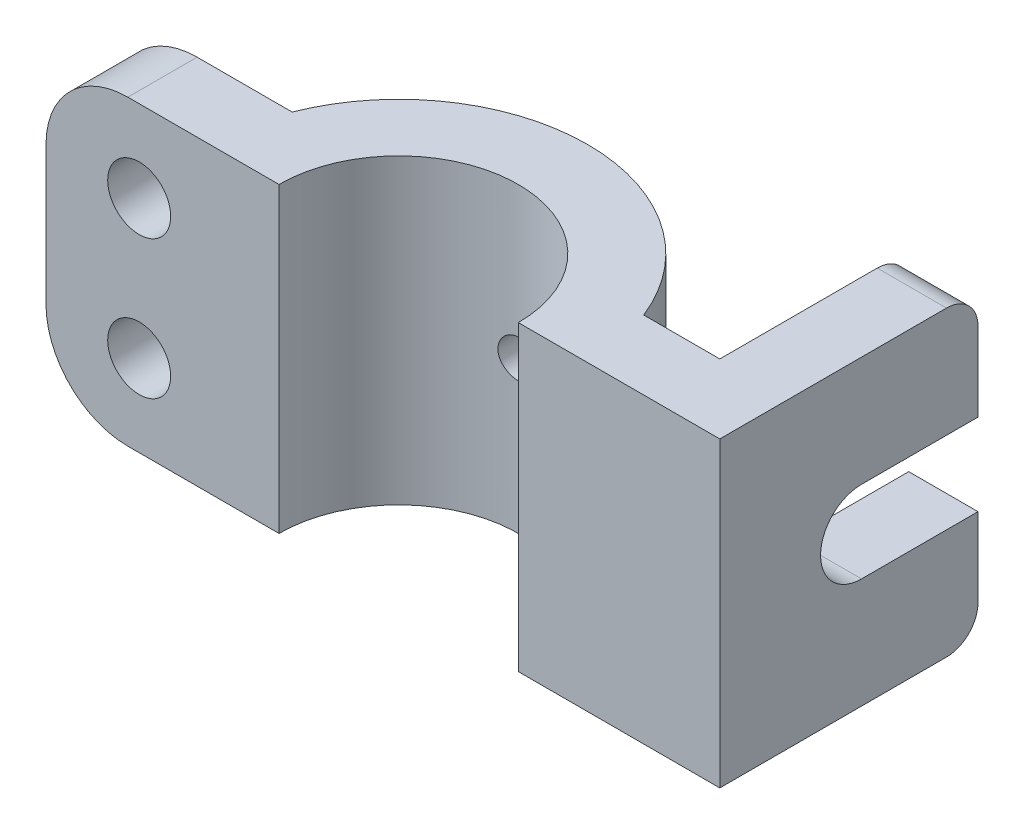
ISO-10303-21;
HEADER;
FILE_DESCRIPTION(('STEP AP214'),'2;1');
FILE_NAME('part.step','',(''),(''),'','','');
FILE_SCHEMA(('AUTOMOTIVE_DESIGN { 1 0 10303 214 1 1 1 1 }'));
ENDSEC;
DATA;
#1=APPLICATION_CONTEXT('core data for automotive mechanical design processes');
#2=APPLICATION_PROTOCOL_DEFINITION('international standard','automotive_design',2000,#1);
#3=PRODUCT_CONTEXT('',#1,'mechanical');
#4=PRODUCT('Part','Part','',(#3));
#5=PRODUCT_RELATED_PRODUCT_CATEGORY('part','',(#4));
#6=PRODUCT_DEFINITION_FORMATION('','',#4);
#7=PRODUCT_DEFINITION_CONTEXT('part definition',#1,'design');
#8=PRODUCT_DEFINITION('design','',#6,#7);
#9=PRODUCT_DEFINITION_SHAPE('','',#8);
#10=(LENGTH_UNIT() NAMED_UNIT(*) SI_UNIT(.MILLI.,.METRE.));
#11=(NAMED_UNIT(*) PLANE_ANGLE_UNIT() SI_UNIT($,.RADIAN.));
#12=(NAMED_UNIT(*) SI_UNIT($,.STERADIAN.) SOLID_ANGLE_UNIT());
#13=UNCERTAINTY_MEASURE_WITH_UNIT(LENGTH_MEASURE(1.E-05),#10,'distance_accuracy_value','');
#14=(GEOMETRIC_REPRESENTATION_CONTEXT(3) GLOBAL_UNCERTAINTY_ASSIGNED_CONTEXT((#13)) GLOBAL_UNIT_ASSIGNED_CONTEXT((#10,
#11,#12)) REPRESENTATION_CONTEXT('',''));
#15=CARTESIAN_POINT('',(0.,0.,0.));
#16=DIRECTION('',(0.,0.,1.));
#17=DIRECTION('',(1.,0.,0.));
#18=AXIS2_PLACEMENT_3D('',#15,#16,#17);
#19=CARTESIAN_POINT('',(107.,24.,-22.5));
#20=DIRECTION('',(1.,0.,0.));
#21=DIRECTION('',(0.,1.,0.));
#22=AXIS2_PLACEMENT_3D('',#19,#20,#21);
#23=CYLINDRICAL_SURFACE('',#22,6.5);
#24=DIRECTION('',(1.,0.,0.));
#25=VECTOR('',#24,1.);
#26=CARTESIAN_POINT('',(107.,30.5,-22.5));
#27=LINE('',#26,#25);
#28=CARTESIAN_POINT('',(107.,30.5,-22.5));
#29=VERTEX_POINT('',#28);
#30=CARTESIAN_POINT('',(96.,30.5,-22.5));
#31=VERTEX_POINT('',#30);
#32=EDGE_CURVE('E242',#29,#31,#27,.F.);
#33=ORIENTED_EDGE('',*,*,#32,.F.);
#34=CARTESIAN_POINT('',(107.,24.,-22.5));
#35=DIRECTION('',(1.,0.,0.));
#36=DIRECTION('',(0.,0.,-1.));
#37=AXIS2_PLACEMENT_3D('',#34,#35,#36);
#38=CIRCLE('',#37,6.5);
#39=CARTESIAN_POINT('',(107.,17.5,-22.5));
#40=VERTEX_POINT('',#39);
#41=EDGE_CURVE('E339',#29,#40,#38,.T.);
#42=ORIENTED_EDGE('',*,*,#41,.T.);
#43=DIRECTION('',(1.,0.,0.));
#44=VECTOR('',#43,1.);
#45=CARTESIAN_POINT('',(107.,17.5,-22.5));
#46=LINE('',#45,#44);
#47=CARTESIAN_POINT('',(96.,17.5,-22.5));
#48=VERTEX_POINT('',#47);
#49=EDGE_CURVE('E181',#48,#40,#46,.T.);
#50=ORIENTED_EDGE('',*,*,#49,.F.);
#51=CARTESIAN_POINT('',(96.,24.,-22.5));
#52=DIRECTION('',(-1.,0.,0.));
#53=DIRECTION('',(0.,0.,1.));
#54=AXIS2_PLACEMENT_3D('',#51,#52,#53);
#55=CIRCLE('',#54,6.5);
#56=EDGE_CURVE('E336',#48,#31,#55,.T.);
#57=ORIENTED_EDGE('',*,*,#56,.T.);
#58=EDGE_LOOP('',(#33,#42,#50,#57));
#59=FACE_BOUND('',#58,.T.);
#60=ADVANCED_FACE('F47',(#59),#23,.F.);
#61=CARTESIAN_POINT('',(0.,48.,-41.));
#62=DIRECTION('',(0.,0.,-1.));
#63=DIRECTION('',(-1.,0.,0.));
#64=AXIS2_PLACEMENT_3D('',#61,#62,#63);
#65=PLANE('',#64);
#66=DIRECTION('',(0.,-1.,0.));
#67=VECTOR('',#66,1.);
#68=CARTESIAN_POINT('',(96.,48.,-41.));
#69=LINE('',#68,#67);
#70=CARTESIAN_POINT('',(96.,43.,-41.));
#71=VERTEX_POINT('',#70);
#72=CARTESIAN_POINT('',(96.,30.5,-41.));
#73=VERTEX_POINT('',#72);
#74=EDGE_CURVE('E202',#71,#73,#69,.T.);
#75=ORIENTED_EDGE('',*,*,#74,.F.);
#76=DIRECTION('',(1.,0.,0.));
#77=VECTOR('',#76,1.);
#78=CARTESIAN_POINT('',(0.,43.,-41.));
#79=LINE('',#78,#77);
#80=CARTESIAN_POINT('',(107.,43.,-41.));
#81=VERTEX_POINT('',#80);
#82=EDGE_CURVE('E56',#71,#81,#79,.T.);
#83=ORIENTED_EDGE('',*,*,#82,.T.);
#84=DIRECTION('',(0.,-1.,0.));
#85=VECTOR('',#84,1.);
#86=CARTESIAN_POINT('',(107.,48.,-41.));
#87=LINE('',#86,#85);
#88=CARTESIAN_POINT('',(107.,30.5,-41.));
#89=VERTEX_POINT('',#88);
#90=EDGE_CURVE('E201',#81,#89,#87,.T.);
#91=ORIENTED_EDGE('',*,*,#90,.T.);
#92=DIRECTION('',(1.,0.,0.));
#93=VECTOR('',#92,1.);
#94=CARTESIAN_POINT('',(107.,30.5,-41.));
#95=LINE('',#94,#93);
#96=EDGE_CURVE('E186',#73,#89,#95,.T.);
#97=ORIENTED_EDGE('',*,*,#96,.F.);
#98=EDGE_LOOP('',(#75,#83,#91,#97));
#99=FACE_BOUND('',#98,.T.);
#100=ADVANCED_FACE('F288',(#99),#65,.T.);
#101=CARTESIAN_POINT('',(56.,48.,0.));
#102=DIRECTION('',(0.,-1.,0.));
#103=DIRECTION('',(0.,0.,-1.));
#104=AXIS2_PLACEMENT_3D('',#101,#102,#103);
#105=CYLINDRICAL_SURFACE('',#104,19.);
#106=CARTESIAN_POINT('',(56.,0.,0.));
#107=DIRECTION('',(0.,1.,0.));
#108=DIRECTION('',(0.,0.,1.));
#109=AXIS2_PLACEMENT_3D('',#106,#107,#108);
#110=CIRCLE('',#109,19.);
#111=CARTESIAN_POINT('',(75.,0.,0.));
#112=VERTEX_POINT('',#111);
#113=CARTESIAN_POINT('',(37.,0.,0.));
#114=VERTEX_POINT('',#113);
#115=EDGE_CURVE('E416',#112,#114,#110,.T.);
#116=ORIENTED_EDGE('',*,*,#115,.F.);
#117=DIRECTION('',(0.,-1.,0.));
#118=VECTOR('',#117,1.);
#119=CARTESIAN_POINT('',(75.,48.,0.));
#120=LINE('',#119,#118);
#121=CARTESIAN_POINT('',(75.,48.,0.));
#122=VERTEX_POINT('',#121);
#123=EDGE_CURVE('E213',#122,#112,#120,.T.);
#124=ORIENTED_EDGE('',*,*,#123,.F.);
#125=CARTESIAN_POINT('',(56.,48.,0.));
#126=DIRECTION('',(0.,1.,0.));
#127=DIRECTION('',(0.,0.,1.));
#128=AXIS2_PLACEMENT_3D('',#125,#126,#127);
#129=CIRCLE('',#128,19.);
#130=CARTESIAN_POINT('',(37.,48.,0.));
#131=VERTEX_POINT('',#130);
#132=EDGE_CURVE('E394',#122,#131,#129,.T.);
#133=ORIENTED_EDGE('',*,*,#132,.T.);
#134=DIRECTION('',(0.,-1.,0.));
#135=VECTOR('',#134,1.);
#136=CARTESIAN_POINT('',(37.,48.,0.));
#137=LINE('',#136,#135);
#138=EDGE_CURVE('E386',#131,#114,#137,.T.);
#139=ORIENTED_EDGE('',*,*,#138,.T.);
#140=EDGE_LOOP('',(#116,#124,#133,#139));
#141=FACE_BOUND('',#140,.T.);
#142=CARTESIAN_POINT('',(59.,24.,-18.7616630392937));
#143=CARTESIAN_POINT('',(58.9999931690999,23.832619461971,-18.7616659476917));
#144=CARTESIAN_POINT('',(58.9859444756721,23.6651444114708,-18.7639271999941));
#145=CARTESIAN_POINT('',(58.9301401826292,23.3348843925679,-18.7727207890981));
#146=CARTESIAN_POINT('',(58.8883582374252,23.1721040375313,-18.7792571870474));
#147=CARTESIAN_POINT('',(58.7783752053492,22.8560612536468,-18.7958427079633));
#148=CARTESIAN_POINT('',(58.7101952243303,22.7027913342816,-18.8058890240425));
#149=CARTESIAN_POINT('',(58.5494025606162,22.4098861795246,-18.8283590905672));
#150=CARTESIAN_POINT('',(58.4567929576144,22.2702492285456,-18.8407825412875));
#151=CARTESIAN_POINT('',(58.248894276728,22.0073175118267,-18.8667300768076));
#152=CARTESIAN_POINT('',(58.133431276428,21.8841610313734,-18.8802621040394));
#153=CARTESIAN_POINT('',(57.8834790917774,21.6588858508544,-18.9068313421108));
#154=CARTESIAN_POINT('',(57.7489888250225,21.5567683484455,-18.9198685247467));
#155=CARTESIAN_POINT('',(57.4639090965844,21.375955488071,-18.9440626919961));
#156=CARTESIAN_POINT('',(57.3132375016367,21.2973881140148,-18.9552092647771));
#157=CARTESIAN_POINT('',(57.000630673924,21.1667276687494,-18.9742781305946));
#158=CARTESIAN_POINT('',(56.8386960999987,21.1146330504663,-18.9822006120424));
#159=CARTESIAN_POINT('',(56.5095864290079,21.0388178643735,-18.9938725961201));
#160=CARTESIAN_POINT('',(56.342465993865,21.0148653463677,-18.9976561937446));
#161=CARTESIAN_POINT('',(56.0065381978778,20.9952935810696,-19.0007410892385));
#162=CARTESIAN_POINT('',(55.8377309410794,20.999672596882,-19.0000426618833));
#163=CARTESIAN_POINT('',(55.5048053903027,21.0364575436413,-18.9942693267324));
#164=CARTESIAN_POINT('',(55.3406587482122,21.0686138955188,-18.9892333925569));
#165=CARTESIAN_POINT('',(55.0201208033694,21.1596483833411,-18.9753943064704));
#166=CARTESIAN_POINT('',(54.8637297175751,21.2185272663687,-18.9665910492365));
#167=CARTESIAN_POINT('',(54.5623929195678,21.3615875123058,-18.9461397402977));
#168=CARTESIAN_POINT('',(54.4174974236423,21.445872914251,-18.9344800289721));
#169=CARTESIAN_POINT('',(54.1438123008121,21.6372775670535,-18.9096134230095));
#170=CARTESIAN_POINT('',(54.0150238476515,21.7443984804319,-18.8964064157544));
#171=CARTESIAN_POINT('',(53.7757358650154,21.979820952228,-18.8697464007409));
#172=CARTESIAN_POINT('',(53.6654508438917,22.1083405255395,-18.8562922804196));
#173=CARTESIAN_POINT('',(53.467978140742,22.3821742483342,-18.8307941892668));
#174=CARTESIAN_POINT('',(53.3807906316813,22.5274885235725,-18.8187502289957));
#175=CARTESIAN_POINT('',(53.2319528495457,22.8310218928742,-18.7974360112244));
#176=CARTESIAN_POINT('',(53.1703263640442,22.9892528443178,-18.7881683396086));
#177=CARTESIAN_POINT('',(53.0745850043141,23.3139988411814,-18.773500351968));
#178=CARTESIAN_POINT('',(53.0404679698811,23.4805132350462,-18.7680997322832));
#179=CARTESIAN_POINT('',(53.0010117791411,23.8151859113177,-18.7618354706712));
#180=CARTESIAN_POINT('',(52.995367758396,23.9833073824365,-18.7609237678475));
#181=CARTESIAN_POINT('',(53.0122072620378,24.3180941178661,-18.7636127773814));
#182=CARTESIAN_POINT('',(53.0346898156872,24.4847594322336,-18.7672133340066));
#183=CARTESIAN_POINT('',(53.1068850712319,24.8109473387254,-18.7784769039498));
#184=CARTESIAN_POINT('',(53.1564443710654,24.9705047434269,-18.7861170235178));
#185=CARTESIAN_POINT('',(53.2812261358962,25.2790486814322,-18.8045798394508));
#186=CARTESIAN_POINT('',(53.3564499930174,25.4280346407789,-18.8154027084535));
#187=CARTESIAN_POINT('',(53.5311520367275,25.7125686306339,-18.8391240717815));
#188=CARTESIAN_POINT('',(53.6308266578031,25.8479946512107,-18.8520390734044));
#189=CARTESIAN_POINT('',(53.8513293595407,26.1003069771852,-18.8784404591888));
#190=CARTESIAN_POINT('',(53.9721587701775,26.21719211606,-18.8919268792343));
#191=CARTESIAN_POINT('',(54.2328874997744,26.4302080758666,-18.9181025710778));
#192=CARTESIAN_POINT('',(54.3729533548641,26.5261362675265,-18.930783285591));
#193=CARTESIAN_POINT('',(54.6673892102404,26.6931000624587,-18.9537838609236));
#194=CARTESIAN_POINT('',(54.82175878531,26.7641364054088,-18.9641037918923));
#195=CARTESIAN_POINT('',(55.1398016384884,26.878980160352,-18.9811826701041));
#196=CARTESIAN_POINT('',(55.3034349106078,26.9228961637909,-18.9879558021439));
#197=CARTESIAN_POINT('',(55.635868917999,26.9826032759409,-18.997237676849));
#198=CARTESIAN_POINT('',(55.8046692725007,26.9983964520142,-18.999746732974));
#199=CARTESIAN_POINT('',(56.1406849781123,27.0013549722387,-19.0002140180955));
#200=CARTESIAN_POINT('',(56.3078976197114,26.9888295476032,-18.9982214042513));
#201=CARTESIAN_POINT('',(56.6378065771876,26.936172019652,-18.9900089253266));
#202=CARTESIAN_POINT('',(56.8005029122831,26.8960400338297,-18.9837890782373));
#203=CARTESIAN_POINT('',(57.1166606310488,26.7894224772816,-18.9678180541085));
#204=CARTESIAN_POINT('',(57.2701301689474,26.7229605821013,-18.9580700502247));
#205=CARTESIAN_POINT('',(57.5637877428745,26.5656034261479,-18.936110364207));
#206=CARTESIAN_POINT('',(57.7039752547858,26.4747072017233,-18.9238985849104));
#207=CARTESIAN_POINT('',(57.9686529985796,26.2699534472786,-18.8982087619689));
#208=CARTESIAN_POINT('',(58.092966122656,26.1558684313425,-18.8847189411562));
#209=CARTESIAN_POINT('',(58.3207945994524,25.9084539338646,-18.8580779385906));
#210=CARTESIAN_POINT('',(58.4243050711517,25.7751199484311,-18.8449268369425));
#211=CARTESIAN_POINT('',(58.6081801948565,25.4920031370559,-18.8203634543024));
#212=CARTESIAN_POINT('',(58.688395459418,25.3421223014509,-18.8089626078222));
#213=CARTESIAN_POINT('',(58.8223905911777,25.0309004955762,-18.7893250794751));
#214=CARTESIAN_POINT('',(58.8761974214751,24.8695714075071,-18.7810851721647));
#215=CARTESIAN_POINT('',(58.9438782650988,24.5896342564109,-18.7705711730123));
#216=CARTESIAN_POINT('',(58.9648910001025,24.472740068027,-18.7672487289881));
#217=CARTESIAN_POINT('',(58.9929541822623,24.2372463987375,-18.7627936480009));
#218=CARTESIAN_POINT('',(59.0000048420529,24.1186469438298,-18.7616609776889));
#219=CARTESIAN_POINT('',(59.,24.,-18.7616630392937));
#220=B_SPLINE_CURVE_WITH_KNOTS('',3,(#142,#143,#144,#145,#146,#147,#148,#149,#150,#151,#152,
#153,#154,#155,#156,#157,#158,#159,#160,#161,#162,#163,#164,#165,#166,#167,#168,#169,#170,#171,
#172,#173,#174,#175,#176,#177,#178,#179,#180,#181,#182,#183,#184,#185,#186,#187,#188,#189,#190,
#191,#192,#193,#194,#195,#196,#197,#198,#199,#200,#201,#202,#203,#204,#205,#206,#207,#208,#209,
#210,#211,#212,#213,#214,#215,#216,#217,#218,#219),.UNSPECIFIED.,.T.,.F.,(4,2,2,2,2,2,2,2,2,2,2,
2,2,2,2,2,2,2,2,2,2,2,2,2,2,2,2,2,2,2,2,2,2,2,2,2,2,2,4),(0.,0.501707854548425,1.00389299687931,
1.50567745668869,2.0073986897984,2.51309615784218,3.01882240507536,3.5272491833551,
4.03564624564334,4.53982297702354,5.04396879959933,5.54363144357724,6.04330805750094,
6.54505929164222,7.04684706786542,7.55410094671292,8.06135862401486,8.56908731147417,
9.07677612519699,9.57901733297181,10.0812412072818,10.5806488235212,11.0800835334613,
11.5836701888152,12.0872885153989,12.5955796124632,13.1038556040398,13.6100830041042,
14.1162731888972,14.6169626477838,15.1176499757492,15.6178881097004,16.118145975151,
16.6235713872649,17.1291152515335,17.6378328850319,18.1460300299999,18.5016688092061,
18.8573021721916),.UNSPECIFIED.);
#221=CARTESIAN_POINT('',(59.,24.,-18.7616630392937));
#222=VERTEX_POINT('',#221);
#223=EDGE_CURVE('E252',#222,#222,#220,.T.);
#224=ORIENTED_EDGE('',*,*,#223,.T.);
#225=EDGE_LOOP('',(#224));
#226=FACE_BOUND('',#225,.T.);
#227=ADVANCED_FACE('F283',(#141,#226),#105,.F.);
#228=CARTESIAN_POINT('',(56.,48.,0.));
#229=DIRECTION('',(0.,-1.,0.));
#230=DIRECTION('',(0.,0.,-1.));
#231=AXIS2_PLACEMENT_3D('',#228,#229,#230);
#232=CYLINDRICAL_SURFACE('',#231,30.);
#233=CARTESIAN_POINT('',(56.,0.,0.));
#234=DIRECTION('',(0.,1.,0.));
#235=DIRECTION('',(0.,0.,1.));
#236=AXIS2_PLACEMENT_3D('',#233,#234,#235);
#237=CIRCLE('',#236,30.);
#238=CARTESIAN_POINT('',(83.9105714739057,0.,-11.));
#239=VERTEX_POINT('',#238);
#240=CARTESIAN_POINT('',(28.0894285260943,0.,-11.));
#241=VERTEX_POINT('',#240);
#242=EDGE_CURVE('E398',#239,#241,#237,.T.);
#243=ORIENTED_EDGE('',*,*,#242,.T.);
#244=DIRECTION('',(0.,-1.,0.));
#245=VECTOR('',#244,1.);
#246=CARTESIAN_POINT('',(28.0894285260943,48.,-11.));
#247=LINE('',#246,#245);
#248=CARTESIAN_POINT('',(28.0894285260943,48.,-11.));
#249=VERTEX_POINT('',#248);
#250=EDGE_CURVE('E372',#249,#241,#247,.T.);
#251=ORIENTED_EDGE('',*,*,#250,.F.);
#252=CARTESIAN_POINT('',(56.,48.,0.));
#253=DIRECTION('',(0.,1.,0.));
#254=DIRECTION('',(0.,0.,1.));
#255=AXIS2_PLACEMENT_3D('',#252,#253,#254);
#256=CIRCLE('',#255,30.);
#257=CARTESIAN_POINT('',(83.9105714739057,48.,-11.));
#258=VERTEX_POINT('',#257);
#259=EDGE_CURVE('E426',#258,#249,#256,.T.);
#260=ORIENTED_EDGE('',*,*,#259,.F.);
#261=DIRECTION('',(0.,-1.,0.));
#262=VECTOR('',#261,1.);
#263=CARTESIAN_POINT('',(83.9105714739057,48.,-11.));
#264=LINE('',#263,#262);
#265=EDGE_CURVE('E367',#258,#239,#264,.T.);
#266=ORIENTED_EDGE('',*,*,#265,.T.);
#267=EDGE_LOOP('',(#243,#251,#260,#266));
#268=FACE_BOUND('',#267,.T.);
#269=CARTESIAN_POINT('',(59.,24.,-29.8496231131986));
#270=CARTESIAN_POINT('',(58.9999927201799,23.8319413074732,-29.8496250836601));
#271=CARTESIAN_POINT('',(58.9858305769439,23.6637714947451,-29.8510577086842));
#272=CARTESIAN_POINT('',(58.9295489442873,23.3320944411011,-29.856632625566));
#273=CARTESIAN_POINT('',(58.887398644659,23.1685925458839,-29.8607779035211));
#274=CARTESIAN_POINT('',(58.7763803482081,22.8511025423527,-29.8713039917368));
#275=CARTESIAN_POINT('',(58.7075285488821,22.6971087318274,-29.8776834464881));
#276=CARTESIAN_POINT('',(58.545092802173,22.402896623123,-29.8919574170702));
#277=CARTESIAN_POINT('',(58.4515137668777,22.2626755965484,-29.8998516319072));
#278=CARTESIAN_POINT('',(58.2419142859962,21.999446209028,-29.9162978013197));
#279=CARTESIAN_POINT('',(58.1258222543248,21.8764949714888,-29.9248518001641));
#280=CARTESIAN_POINT('',(57.8746451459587,21.6517871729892,-29.9416351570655));
#281=CARTESIAN_POINT('',(57.7395592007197,21.550031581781,-29.9498645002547));
#282=CARTESIAN_POINT('',(57.453879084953,21.3704062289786,-29.9650914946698));
#283=CARTESIAN_POINT('',(57.3032529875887,21.292587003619,-29.9720865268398));
#284=CARTESIAN_POINT('',(56.9909899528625,21.1633667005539,-29.9840345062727));
#285=CARTESIAN_POINT('',(56.8293532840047,21.1119649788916,-29.9889875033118));
#286=CARTESIAN_POINT('',(56.5002343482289,21.0372062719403,-29.9962789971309));
#287=CARTESIAN_POINT('',(56.3327735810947,21.0137555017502,-29.9986262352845));
#288=CARTESIAN_POINT('',(55.9962777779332,20.9952741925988,-30.0004714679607));
#289=CARTESIAN_POINT('',(55.8272427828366,21.0002429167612,-29.9999695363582));
#290=CARTESIAN_POINT('',(55.4930334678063,21.0383834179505,-29.9961801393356));
#291=CARTESIAN_POINT('',(55.3278475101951,21.0714543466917,-29.9929026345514));
#292=CARTESIAN_POINT('',(55.0053824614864,21.1647033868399,-29.9839418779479));
#293=CARTESIAN_POINT('',(54.8481034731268,21.2248818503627,-29.9782585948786));
#294=CARTESIAN_POINT('',(54.5455990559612,21.3707482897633,-29.9651081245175));
#295=CARTESIAN_POINT('',(54.4003952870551,21.4564808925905,-29.9576378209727));
#296=CARTESIAN_POINT('',(54.1263994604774,21.6509895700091,-29.9417515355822));
#297=CARTESIAN_POINT('',(53.9976078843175,21.7597663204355,-29.9333355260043));
#298=CARTESIAN_POINT('',(53.7595016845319,21.9978426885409,-29.9164588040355));
#299=CARTESIAN_POINT('',(53.650274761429,22.1272300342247,-29.9079980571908));
#300=CARTESIAN_POINT('',(53.4550773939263,22.4025505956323,-29.8920221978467));
#301=CARTESIAN_POINT('',(53.3691069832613,22.5484838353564,-29.8845070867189));
#302=CARTESIAN_POINT('',(53.2228634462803,22.8528210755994,-29.8712726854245));
#303=CARTESIAN_POINT('',(53.1625957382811,23.0112276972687,-29.8655537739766));
#304=CARTESIAN_POINT('',(53.0695377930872,23.3359818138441,-29.8565670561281));
#305=CARTESIAN_POINT('',(53.0367467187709,23.5023290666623,-29.853299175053));
#306=CARTESIAN_POINT('',(52.9996856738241,23.8374725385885,-29.8495974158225));
#307=CARTESIAN_POINT('',(52.9952930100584,24.0062550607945,-29.8491513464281));
#308=CARTESIAN_POINT('',(53.0148312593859,24.3421537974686,-29.8511115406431));
#309=CARTESIAN_POINT('',(53.0387617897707,24.5092700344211,-29.8535177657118));
#310=CARTESIAN_POINT('',(53.1141644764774,24.836734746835,-29.860900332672));
#311=CARTESIAN_POINT('',(53.1655786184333,24.997096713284,-29.8658712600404));
#312=CARTESIAN_POINT('',(53.2944298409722,25.3069201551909,-29.8778187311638));
#313=CARTESIAN_POINT('',(53.3718675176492,25.4563813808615,-29.8847953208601));
#314=CARTESIAN_POINT('',(53.5508749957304,25.7407199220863,-29.8999975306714));
#315=CARTESIAN_POINT('',(53.6525261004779,25.8755458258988,-29.9082273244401));
#316=CARTESIAN_POINT('',(53.8769583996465,26.1262651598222,-29.9249949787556));
#317=CARTESIAN_POINT('',(53.9997401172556,26.2421581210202,-29.933532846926));
#318=CARTESIAN_POINT('',(54.2634805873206,26.4521449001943,-29.949991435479));
#319=CARTESIAN_POINT('',(54.4045032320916,26.5461586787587,-29.9579098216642));
#320=CARTESIAN_POINT('',(54.7004068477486,26.7091676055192,-29.9722032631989));
#321=CARTESIAN_POINT('',(54.8552876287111,26.7781630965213,-29.9785783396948));
#322=CARTESIAN_POINT('',(55.1742316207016,26.889041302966,-29.9890563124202));
#323=CARTESIAN_POINT('',(55.3382778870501,26.9309723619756,-29.9931632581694));
#324=CARTESIAN_POINT('',(55.671125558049,26.9866892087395,-29.9986588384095));
#325=CARTESIAN_POINT('',(55.8399268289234,27.0004757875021,-30.0000475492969));
#326=CARTESIAN_POINT('',(56.1767066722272,26.9995012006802,-29.9999501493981));
#327=CARTESIAN_POINT('',(56.3446856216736,26.98486428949,-29.9984765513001));
#328=CARTESIAN_POINT('',(56.6757856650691,26.9277187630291,-29.9928448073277));
#329=CARTESIAN_POINT('',(56.8389067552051,26.8852101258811,-29.9886866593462));
#330=CARTESIAN_POINT('',(57.1556597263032,26.7735622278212,-29.9781517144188));
#331=CARTESIAN_POINT('',(57.3092928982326,26.7044265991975,-29.9717752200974));
#332=CARTESIAN_POINT('',(57.6027938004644,26.5415004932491,-29.9575143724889));
#333=CARTESIAN_POINT('',(57.7426616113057,26.4477101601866,-29.9496300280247));
#334=CARTESIAN_POINT('',(58.0052981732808,26.2376711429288,-29.9331955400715));
#335=CARTESIAN_POINT('',(58.127992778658,26.1213299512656,-29.9246427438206));
#336=CARTESIAN_POINT('',(58.3521732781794,25.8696739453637,-29.9078577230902));
#337=CARTESIAN_POINT('',(58.4536540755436,25.7343545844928,-29.8996255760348));
#338=CARTESIAN_POINT('',(58.6327299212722,25.4482069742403,-29.8843915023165));
#339=CARTESIAN_POINT('',(58.7102635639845,25.2973401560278,-29.8773927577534));
#340=CARTESIAN_POINT('',(58.8387941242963,24.9847551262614,-29.8654558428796));
#341=CARTESIAN_POINT('',(58.8898209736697,24.8230493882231,-29.8605153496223));
#342=CARTESIAN_POINT('',(58.9511650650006,24.5503567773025,-29.8545002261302));
#343=CARTESIAN_POINT('',(58.9694531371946,24.4411132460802,-29.8526799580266));
#344=CARTESIAN_POINT('',(58.9938729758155,24.2212625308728,-29.8502407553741));
#345=CARTESIAN_POINT('',(59.0000047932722,24.1106553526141,-29.8496218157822));
#346=CARTESIAN_POINT('',(59.,24.,-29.8496231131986));
#347=B_SPLINE_CURVE_WITH_KNOTS('',3,(#269,#270,#271,#272,#273,#274,#275,#276,#277,#278,#279,
#280,#281,#282,#283,#284,#285,#286,#287,#288,#289,#290,#291,#292,#293,#294,#295,#296,#297,#298,
#299,#300,#301,#302,#303,#304,#305,#306,#307,#308,#309,#310,#311,#312,#313,#314,#315,#316,#317,
#318,#319,#320,#321,#322,#323,#324,#325,#326,#327,#328,#329,#330,#331,#332,#333,#334,#335,#336,
#337,#338,#339,#340,#341,#342,#343,#344,#345,#346),.UNSPECIFIED.,.T.,.F.,(4,2,2,2,2,2,2,2,2,2,2,
2,2,2,2,2,2,2,2,2,2,2,2,2,2,2,2,2,2,2,2,2,2,2,2,2,2,2,4),(0.,0.503771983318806,1.00809945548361,
1.51212147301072,2.01604344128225,2.52159484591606,3.02716937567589,3.53380409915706,
4.04042647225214,4.5453441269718,5.05024868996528,5.55334895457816,6.05645575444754,
6.56044636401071,7.06445175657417,7.57066275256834,8.07687448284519,8.58319287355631,
9.08949583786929,9.59360988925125,10.0977171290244,10.6007644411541,11.1038232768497,
11.6085956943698,12.1133806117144,12.6199841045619,13.1265806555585,13.6322697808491,
14.1379446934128,14.6414140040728,15.144883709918,15.6482847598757,16.1516828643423,
16.657191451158,17.1628213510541,17.6697372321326,18.1760794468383,18.5077808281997,
18.8394808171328),.UNSPECIFIED.);
#348=CARTESIAN_POINT('',(59.,24.,-29.8496231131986));
#349=VERTEX_POINT('',#348);
#350=EDGE_CURVE('E243',#349,#349,#347,.T.);
#351=ORIENTED_EDGE('',*,*,#350,.F.);
#352=EDGE_LOOP('',(#351));
#353=FACE_BOUND('',#352,.T.);
#354=ADVANCED_FACE('F255',(#268,#353),#232,.T.);
#355=CARTESIAN_POINT('',(0.,48.,0.));
#356=DIRECTION('',(0.,0.,1.));
#357=DIRECTION('',(1.,0.,0.));
#358=AXIS2_PLACEMENT_3D('',#355,#356,#357);
#359=PLANE('',#358);
#360=DIRECTION('',(-1.,0.,0.));
#361=VECTOR('',#360,1.);
#362=CARTESIAN_POINT('',(0.,0.,0.));
#363=LINE('',#362,#361);
#364=CARTESIAN_POINT('',(107.,0.,0.));
#365=VERTEX_POINT('',#364);
#366=EDGE_CURVE('E412',#365,#112,#363,.T.);
#367=ORIENTED_EDGE('',*,*,#366,.F.);
#368=DIRECTION('',(0.,-1.,0.));
#369=VECTOR('',#368,1.);
#370=CARTESIAN_POINT('',(107.,48.,0.));
#371=LINE('',#370,#369);
#372=CARTESIAN_POINT('',(107.,48.,0.));
#373=VERTEX_POINT('',#372);
#374=EDGE_CURVE('E206',#373,#365,#371,.T.);
#375=ORIENTED_EDGE('',*,*,#374,.F.);
#376=DIRECTION('',(-1.,0.,0.));
#377=VECTOR('',#376,1.);
#378=CARTESIAN_POINT('',(0.,48.,0.));
#379=LINE('',#378,#377);
#380=EDGE_CURVE('E439',#373,#122,#379,.T.);
#381=ORIENTED_EDGE('',*,*,#380,.T.);
#382=ORIENTED_EDGE('',*,*,#123,.T.);
#383=EDGE_LOOP('',(#367,#375,#381,#382));
#384=FACE_BOUND('',#383,.T.);
#385=ADVANCED_FACE('F290',(#384),#359,.T.);
#386=CARTESIAN_POINT('',(107.,48.,0.));
#387=DIRECTION('',(1.,0.,0.));
#388=DIRECTION('',(0.,0.,-1.));
#389=AXIS2_PLACEMENT_3D('',#386,#387,#388);
#390=PLANE('',#389);
#391=DIRECTION('',(0.,0.,1.));
#392=VECTOR('',#391,1.);
#393=CARTESIAN_POINT('',(107.,0.,0.));
#394=LINE('',#393,#392);
#395=CARTESIAN_POINT('',(107.,0.,-36.));
#396=VERTEX_POINT('',#395);
#397=EDGE_CURVE('E409',#396,#365,#394,.T.);
#398=ORIENTED_EDGE('',*,*,#397,.F.);
#399=CARTESIAN_POINT('',(107.,5.,-36.));
#400=DIRECTION('',(1.,0.,0.));
#401=DIRECTION('',(0.,0.,-1.));
#402=AXIS2_PLACEMENT_3D('',#399,#400,#401);
#403=CIRCLE('',#402,5.);
#404=CARTESIAN_POINT('',(107.,5.,-41.));
#405=VERTEX_POINT('',#404);
#406=EDGE_CURVE('E199',#396,#405,#403,.T.);
#407=ORIENTED_EDGE('',*,*,#406,.T.);
#408=CARTESIAN_POINT('',(107.,17.5,-41.));
#409=VERTEX_POINT('',#408);
#410=EDGE_CURVE('E191',#409,#405,#87,.T.);
#411=ORIENTED_EDGE('',*,*,#410,.F.);
#412=DIRECTION('',(0.,0.,-1.));
#413=VECTOR('',#412,1.);
#414=CARTESIAN_POINT('',(107.,17.5,-16.));
#415=LINE('',#414,#413);
#416=EDGE_CURVE('E174',#40,#409,#415,.T.);
#417=ORIENTED_EDGE('',*,*,#416,.F.);
#418=ORIENTED_EDGE('',*,*,#41,.F.);
#419=DIRECTION('',(0.,0.,-1.));
#420=VECTOR('',#419,1.);
#421=CARTESIAN_POINT('',(107.,30.5,-16.));
#422=LINE('',#421,#420);
#423=EDGE_CURVE('E253',#29,#89,#422,.T.);
#424=ORIENTED_EDGE('',*,*,#423,.T.);
#425=ORIENTED_EDGE('',*,*,#90,.F.);
#426=CARTESIAN_POINT('',(107.,43.,-36.));
#427=DIRECTION('',(1.,0.,0.));
#428=DIRECTION('',(0.,0.,-1.));
#429=AXIS2_PLACEMENT_3D('',#426,#427,#428);
#430=CIRCLE('',#429,5.);
#431=CARTESIAN_POINT('',(107.,48.,-36.));
#432=VERTEX_POINT('',#431);
#433=EDGE_CURVE('E331',#81,#432,#430,.T.);
#434=ORIENTED_EDGE('',*,*,#433,.T.);
#435=DIRECTION('',(0.,0.,1.));
#436=VECTOR('',#435,1.);
#437=CARTESIAN_POINT('',(107.,48.,0.));
#438=LINE('',#437,#436);
#439=EDGE_CURVE('E436',#432,#373,#438,.T.);
#440=ORIENTED_EDGE('',*,*,#439,.T.);
#441=ORIENTED_EDGE('',*,*,#374,.T.);
#442=EDGE_LOOP('',(#398,#407,#411,#417,#418,#424,#425,#434,#440,#441));
#443=FACE_BOUND('',#442,.T.);
#444=ADVANCED_FACE('F198',(#443),#390,.T.);
#445=ORIENTED_EDGE('',*,*,#410,.T.);
#446=DIRECTION('',(1.,0.,0.));
#447=VECTOR('',#446,1.);
#448=CARTESIAN_POINT('',(96.,5.,-41.));
#449=LINE('',#448,#447);
#450=CARTESIAN_POINT('',(96.,5.,-41.));
#451=VERTEX_POINT('',#450);
#452=EDGE_CURVE('E315',#405,#451,#449,.F.);
#453=ORIENTED_EDGE('',*,*,#452,.T.);
#454=CARTESIAN_POINT('',(96.,17.5,-41.));
#455=VERTEX_POINT('',#454);
#456=EDGE_CURVE('E194',#455,#451,#69,.T.);
#457=ORIENTED_EDGE('',*,*,#456,.F.);
#458=DIRECTION('',(-1.,0.,0.));
#459=VECTOR('',#458,1.);
#460=CARTESIAN_POINT('',(107.,17.5,-41.));
#461=LINE('',#460,#459);
#462=EDGE_CURVE('E178',#409,#455,#461,.T.);
#463=ORIENTED_EDGE('',*,*,#462,.F.);
#464=EDGE_LOOP('',(#445,#453,#457,#463));
#465=FACE_BOUND('',#464,.T.);
#466=ADVANCED_FACE('F190',(#465),#65,.T.);
#467=CARTESIAN_POINT('',(96.,48.,0.));
#468=DIRECTION('',(-1.,0.,0.));
#469=DIRECTION('',(0.,0.,1.));
#470=AXIS2_PLACEMENT_3D('',#467,#468,#469);
#471=PLANE('',#470);
#472=ORIENTED_EDGE('',*,*,#456,.T.);
#473=CARTESIAN_POINT('',(96.,5.,-36.));
#474=DIRECTION('',(-1.,0.,0.));
#475=DIRECTION('',(0.,0.,1.));
#476=AXIS2_PLACEMENT_3D('',#473,#474,#475);
#477=CIRCLE('',#476,5.);
#478=CARTESIAN_POINT('',(96.,0.,-36.));
#479=VERTEX_POINT('',#478);
#480=EDGE_CURVE('E314',#451,#479,#477,.T.);
#481=ORIENTED_EDGE('',*,*,#480,.T.);
#482=DIRECTION('',(0.,0.,-1.));
#483=VECTOR('',#482,1.);
#484=CARTESIAN_POINT('',(96.,0.,0.));
#485=LINE('',#484,#483);
#486=CARTESIAN_POINT('',(96.,0.,-11.));
#487=VERTEX_POINT('',#486);
#488=EDGE_CURVE('E406',#487,#479,#485,.T.);
#489=ORIENTED_EDGE('',*,*,#488,.F.);
#490=DIRECTION('',(0.,-1.,0.));
#491=VECTOR('',#490,1.);
#492=CARTESIAN_POINT('',(96.,48.,-11.));
#493=LINE('',#492,#491);
#494=CARTESIAN_POINT('',(96.,48.,-11.));
#495=VERTEX_POINT('',#494);
#496=EDGE_CURVE('E365',#495,#487,#493,.T.);
#497=ORIENTED_EDGE('',*,*,#496,.F.);
#498=DIRECTION('',(0.,0.,-1.));
#499=VECTOR('',#498,1.);
#500=CARTESIAN_POINT('',(96.,48.,0.));
#501=LINE('',#500,#499);
#502=CARTESIAN_POINT('',(96.,48.,-36.));
#503=VERTEX_POINT('',#502);
#504=EDGE_CURVE('E433',#495,#503,#501,.T.);
#505=ORIENTED_EDGE('',*,*,#504,.T.);
#506=CARTESIAN_POINT('',(96.,43.,-36.));
#507=DIRECTION('',(-1.,0.,0.));
#508=DIRECTION('',(0.,0.,1.));
#509=AXIS2_PLACEMENT_3D('',#506,#507,#508);
#510=CIRCLE('',#509,5.);
#511=EDGE_CURVE('E63',#503,#71,#510,.T.);
#512=ORIENTED_EDGE('',*,*,#511,.T.);
#513=ORIENTED_EDGE('',*,*,#74,.T.);
#514=DIRECTION('',(0.,0.,-1.));
#515=VECTOR('',#514,1.);
#516=CARTESIAN_POINT('',(96.,30.5,-16.));
#517=LINE('',#516,#515);
#518=EDGE_CURVE('E350',#31,#73,#517,.T.);
#519=ORIENTED_EDGE('',*,*,#518,.F.);
#520=ORIENTED_EDGE('',*,*,#56,.F.);
#521=DIRECTION('',(0.,0.,-1.));
#522=VECTOR('',#521,1.);
#523=CARTESIAN_POINT('',(96.,17.5,-16.));
#524=LINE('',#523,#522);
#525=EDGE_CURVE('E185',#48,#455,#524,.T.);
#526=ORIENTED_EDGE('',*,*,#525,.T.);
#527=EDGE_LOOP('',(#472,#481,#489,#497,#505,#512,#513,#519,#520,#526));
#528=FACE_BOUND('',#527,.T.);
#529=ADVANCED_FACE('F353',(#528),#471,.T.);
#530=CARTESIAN_POINT('',(0.,48.,-11.));
#531=DIRECTION('',(0.,0.,-1.));
#532=DIRECTION('',(-1.,0.,0.));
#533=AXIS2_PLACEMENT_3D('',#530,#531,#532);
#534=PLANE('',#533);
#535=DIRECTION('',(1.,0.,0.));
#536=VECTOR('',#535,1.);
#537=CARTESIAN_POINT('',(0.,0.,-11.));
#538=LINE('',#537,#536);
#539=EDGE_CURVE('E402',#239,#487,#538,.T.);
#540=ORIENTED_EDGE('',*,*,#539,.F.);
#541=ORIENTED_EDGE('',*,*,#265,.F.);
#542=DIRECTION('',(1.,0.,0.));
#543=VECTOR('',#542,1.);
#544=CARTESIAN_POINT('',(0.,48.,-11.));
#545=LINE('',#544,#543);
#546=EDGE_CURVE('E430',#258,#495,#545,.T.);
#547=ORIENTED_EDGE('',*,*,#546,.T.);
#548=ORIENTED_EDGE('',*,*,#496,.T.);
#549=EDGE_LOOP('',(#540,#541,#547,#548));
#550=FACE_BOUND('',#549,.T.);
#551=ADVANCED_FACE('F489',(#550),#534,.T.);
#552=CARTESIAN_POINT('',(0.,48.,-11.));
#553=DIRECTION('',(0.,0.,-1.));
#554=DIRECTION('',(-1.,0.,0.));
#555=AXIS2_PLACEMENT_3D('',#552,#553,#554);
#556=PLANE('',#555);
#557=CARTESIAN_POINT('',(14.795365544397,35.,-11.));
#558=DIRECTION('',(0.,0.,-1.));
#559=DIRECTION('',(-1.,0.,0.));
#560=AXIS2_PLACEMENT_3D('',#557,#558,#559);
#561=CIRCLE('',#560,5.);
#562=CARTESIAN_POINT('',(9.79536554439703,35.,-11.));
#563=VERTEX_POINT('',#562);
#564=EDGE_CURVE('E452',#563,#563,#561,.T.);
#565=ORIENTED_EDGE('',*,*,#564,.F.);
#566=EDGE_LOOP('',(#565));
#567=FACE_BOUND('',#566,.T.);
#568=CARTESIAN_POINT('',(14.795365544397,13.,-11.));
#569=DIRECTION('',(0.,0.,-1.));
#570=DIRECTION('',(-1.,0.,0.));
#571=AXIS2_PLACEMENT_3D('',#568,#569,#570);
#572=CIRCLE('',#571,5.);
#573=CARTESIAN_POINT('',(9.79536554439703,13.,-11.));
#574=VERTEX_POINT('',#573);
#575=EDGE_CURVE('E449',#574,#574,#572,.T.);
#576=ORIENTED_EDGE('',*,*,#575,.F.);
#577=EDGE_LOOP('',(#576));
#578=FACE_BOUND('',#577,.T.);
#579=DIRECTION('',(1.,0.,0.));
#580=VECTOR('',#579,1.);
#581=CARTESIAN_POINT('',(0.,0.,-11.));
#582=LINE('',#581,#580);
#583=CARTESIAN_POINT('',(13.,0.,-11.));
#584=VERTEX_POINT('',#583);
#585=EDGE_CURVE('E395',#584,#241,#582,.T.);
#586=ORIENTED_EDGE('',*,*,#585,.F.);
#587=CARTESIAN_POINT('',(13.,13.,-11.));
#588=DIRECTION('',(0.,0.,-1.));
#589=DIRECTION('',(-1.,0.,0.));
#590=AXIS2_PLACEMENT_3D('',#587,#588,#589);
#591=CIRCLE('',#590,13.);
#592=CARTESIAN_POINT('',(0.,13.,-11.));
#593=VERTEX_POINT('',#592);
#594=EDGE_CURVE('E223',#584,#593,#591,.T.);
#595=ORIENTED_EDGE('',*,*,#594,.T.);
#596=DIRECTION('',(0.,-1.,0.));
#597=VECTOR('',#596,1.);
#598=CARTESIAN_POINT('',(0.,48.,-11.));
#599=LINE('',#598,#597);
#600=CARTESIAN_POINT('',(0.,35.,-11.));
#601=VERTEX_POINT('',#600);
#602=EDGE_CURVE('E378',#601,#593,#599,.T.);
#603=ORIENTED_EDGE('',*,*,#602,.F.);
#604=CARTESIAN_POINT('',(13.,35.,-11.));
#605=DIRECTION('',(0.,0.,-1.));
#606=DIRECTION('',(-1.,0.,0.));
#607=AXIS2_PLACEMENT_3D('',#604,#605,#606);
#608=CIRCLE('',#607,13.);
#609=CARTESIAN_POINT('',(13.,48.,-11.));
#610=VERTEX_POINT('',#609);
#611=EDGE_CURVE('E220',#601,#610,#608,.T.);
#612=ORIENTED_EDGE('',*,*,#611,.T.);
#613=DIRECTION('',(1.,0.,0.));
#614=VECTOR('',#613,1.);
#615=CARTESIAN_POINT('',(0.,48.,-11.));
#616=LINE('',#615,#614);
#617=EDGE_CURVE('E423',#610,#249,#616,.T.);
#618=ORIENTED_EDGE('',*,*,#617,.T.);
#619=ORIENTED_EDGE('',*,*,#250,.T.);
#620=EDGE_LOOP('',(#586,#595,#603,#612,#618,#619));
#621=FACE_BOUND('',#620,.T.);
#622=ADVANCED_FACE('F486',(#567,#578,#621),#556,.T.);
#623=CARTESIAN_POINT('',(0.,48.,0.));
#624=DIRECTION('',(-1.,0.,0.));
#625=DIRECTION('',(0.,0.,1.));
#626=AXIS2_PLACEMENT_3D('',#623,#624,#625);
#627=PLANE('',#626);
#628=ORIENTED_EDGE('',*,*,#602,.T.);
#629=DIRECTION('',(0.,0.,-1.));
#630=VECTOR('',#629,1.);
#631=CARTESIAN_POINT('',(0.,13.,0.));
#632=LINE('',#631,#630);
#633=CARTESIAN_POINT('',(0.,13.,0.));
#634=VERTEX_POINT('',#633);
#635=EDGE_CURVE('E230',#593,#634,#632,.F.);
#636=ORIENTED_EDGE('',*,*,#635,.T.);
#637=DIRECTION('',(0.,-1.,0.));
#638=VECTOR('',#637,1.);
#639=CARTESIAN_POINT('',(0.,48.,0.));
#640=LINE('',#639,#638);
#641=CARTESIAN_POINT('',(0.,35.,0.));
#642=VERTEX_POINT('',#641);
#643=EDGE_CURVE('E382',#642,#634,#640,.T.);
#644=ORIENTED_EDGE('',*,*,#643,.F.);
#645=DIRECTION('',(0.,0.,-1.));
#646=VECTOR('',#645,1.);
#647=CARTESIAN_POINT('',(0.,35.,0.));
#648=LINE('',#647,#646);
#649=EDGE_CURVE('E226',#642,#601,#648,.T.);
#650=ORIENTED_EDGE('',*,*,#649,.T.);
#651=EDGE_LOOP('',(#628,#636,#644,#650));
#652=FACE_BOUND('',#651,.T.);
#653=ADVANCED_FACE('F484',(#652),#627,.T.);
#654=CARTESIAN_POINT('',(0.,48.,0.));
#655=DIRECTION('',(0.,0.,1.));
#656=DIRECTION('',(1.,0.,0.));
#657=AXIS2_PLACEMENT_3D('',#654,#655,#656);
#658=PLANE('',#657);
#659=CARTESIAN_POINT('',(14.795365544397,35.,0.));
#660=DIRECTION('',(0.,0.,-1.));
#661=DIRECTION('',(-1.,0.,0.));
#662=AXIS2_PLACEMENT_3D('',#659,#660,#661);
#663=CIRCLE('',#662,5.);
#664=CARTESIAN_POINT('',(9.79536554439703,35.,0.));
#665=VERTEX_POINT('',#664);
#666=EDGE_CURVE('E281',#665,#665,#663,.T.);
#667=ORIENTED_EDGE('',*,*,#666,.T.);
#668=EDGE_LOOP('',(#667));
#669=FACE_BOUND('',#668,.T.);
#670=CARTESIAN_POINT('',(14.795365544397,13.,0.));
#671=DIRECTION('',(0.,0.,-1.));
#672=DIRECTION('',(-1.,0.,0.));
#673=AXIS2_PLACEMENT_3D('',#670,#671,#672);
#674=CIRCLE('',#673,5.);
#675=CARTESIAN_POINT('',(9.79536554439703,13.,0.));
#676=VERTEX_POINT('',#675);
#677=EDGE_CURVE('E279',#676,#676,#674,.T.);
#678=ORIENTED_EDGE('',*,*,#677,.T.);
#679=EDGE_LOOP('',(#678));
#680=FACE_BOUND('',#679,.T.);
#681=ORIENTED_EDGE('',*,*,#643,.T.);
#682=CARTESIAN_POINT('',(13.,13.,0.));
#683=DIRECTION('',(0.,0.,1.));
#684=DIRECTION('',(1.,0.,0.));
#685=AXIS2_PLACEMENT_3D('',#682,#683,#684);
#686=CIRCLE('',#685,13.);
#687=CARTESIAN_POINT('',(13.,0.,0.));
#688=VERTEX_POINT('',#687);
#689=EDGE_CURVE('E236',#634,#688,#686,.T.);
#690=ORIENTED_EDGE('',*,*,#689,.T.);
#691=DIRECTION('',(-1.,0.,0.));
#692=VECTOR('',#691,1.);
#693=CARTESIAN_POINT('',(0.,0.,0.));
#694=LINE('',#693,#692);
#695=EDGE_CURVE('E390',#114,#688,#694,.T.);
#696=ORIENTED_EDGE('',*,*,#695,.F.);
#697=ORIENTED_EDGE('',*,*,#138,.F.);
#698=DIRECTION('',(-1.,0.,0.));
#699=VECTOR('',#698,1.);
#700=CARTESIAN_POINT('',(0.,48.,0.));
#701=LINE('',#700,#699);
#702=CARTESIAN_POINT('',(13.,48.,0.));
#703=VERTEX_POINT('',#702);
#704=EDGE_CURVE('E389',#131,#703,#701,.T.);
#705=ORIENTED_EDGE('',*,*,#704,.T.);
#706=CARTESIAN_POINT('',(13.,35.,0.));
#707=DIRECTION('',(0.,0.,1.));
#708=DIRECTION('',(1.,0.,0.));
#709=AXIS2_PLACEMENT_3D('',#706,#707,#708);
#710=CIRCLE('',#709,13.);
#711=EDGE_CURVE('E233',#703,#642,#710,.T.);
#712=ORIENTED_EDGE('',*,*,#711,.T.);
#713=EDGE_LOOP('',(#681,#690,#696,#697,#705,#712));
#714=FACE_BOUND('',#713,.T.);
#715=ADVANCED_FACE('F461',(#669,#680,#714),#658,.T.);
#716=CARTESIAN_POINT('',(0.,48.,0.));
#717=DIRECTION('',(0.,1.,0.));
#718=DIRECTION('',(0.,0.,1.));
#719=AXIS2_PLACEMENT_3D('',#716,#717,#718);
#720=PLANE('',#719);
#721=ORIENTED_EDGE('',*,*,#439,.F.);
#722=DIRECTION('',(1.,0.,0.));
#723=VECTOR('',#722,1.);
#724=CARTESIAN_POINT('',(0.,48.,-36.));
#725=LINE('',#724,#723);
#726=EDGE_CURVE('E11',#432,#503,#725,.F.);
#727=ORIENTED_EDGE('',*,*,#726,.T.);
#728=ORIENTED_EDGE('',*,*,#504,.F.);
#729=ORIENTED_EDGE('',*,*,#546,.F.);
#730=ORIENTED_EDGE('',*,*,#259,.T.);
#731=ORIENTED_EDGE('',*,*,#617,.F.);
#732=DIRECTION('',(0.,0.,-1.));
#733=VECTOR('',#732,1.);
#734=CARTESIAN_POINT('',(13.,48.,0.));
#735=LINE('',#734,#733);
#736=EDGE_CURVE('E239',#610,#703,#735,.F.);
#737=ORIENTED_EDGE('',*,*,#736,.T.);
#738=ORIENTED_EDGE('',*,*,#704,.F.);
#739=ORIENTED_EDGE('',*,*,#132,.F.);
#740=ORIENTED_EDGE('',*,*,#380,.F.);
#741=EDGE_LOOP('',(#721,#727,#728,#729,#730,#731,#737,#738,#739,#740));
#742=FACE_BOUND('',#741,.T.);
#743=ADVANCED_FACE('F474',(#742),#720,.T.);
#744=CARTESIAN_POINT('',(0.,0.,0.));
#745=DIRECTION('',(0.,1.,0.));
#746=DIRECTION('',(0.,0.,1.));
#747=AXIS2_PLACEMENT_3D('',#744,#745,#746);
#748=PLANE('',#747);
#749=ORIENTED_EDGE('',*,*,#488,.T.);
#750=DIRECTION('',(1.,0.,0.));
#751=VECTOR('',#750,1.);
#752=CARTESIAN_POINT('',(107.,0.,-36.));
#753=LINE('',#752,#751);
#754=EDGE_CURVE('E317',#479,#396,#753,.T.);
#755=ORIENTED_EDGE('',*,*,#754,.T.);
#756=ORIENTED_EDGE('',*,*,#397,.T.);
#757=ORIENTED_EDGE('',*,*,#366,.T.);
#758=ORIENTED_EDGE('',*,*,#115,.T.);
#759=ORIENTED_EDGE('',*,*,#695,.T.);
#760=DIRECTION('',(0.,0.,-1.));
#761=VECTOR('',#760,1.);
#762=CARTESIAN_POINT('',(13.,0.,-11.));
#763=LINE('',#762,#761);
#764=EDGE_CURVE('E216',#688,#584,#763,.T.);
#765=ORIENTED_EDGE('',*,*,#764,.T.);
#766=ORIENTED_EDGE('',*,*,#585,.T.);
#767=ORIENTED_EDGE('',*,*,#242,.F.);
#768=ORIENTED_EDGE('',*,*,#539,.T.);
#769=EDGE_LOOP('',(#749,#755,#756,#757,#758,#759,#765,#766,#767,#768));
#770=FACE_BOUND('',#769,.T.);
#771=ADVANCED_FACE('F469',(#770),#748,.F.);
#772=CARTESIAN_POINT('',(14.795365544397,13.,0.));
#773=DIRECTION('',(0.,0.,-1.));
#774=DIRECTION('',(-1.,0.,0.));
#775=AXIS2_PLACEMENT_3D('',#772,#773,#774);
#776=CYLINDRICAL_SURFACE('',#775,5.);
#777=ORIENTED_EDGE('',*,*,#677,.F.);
#778=EDGE_LOOP('',(#777));
#779=FACE_BOUND('',#778,.T.);
#780=ORIENTED_EDGE('',*,*,#575,.T.);
#781=EDGE_LOOP('',(#780));
#782=FACE_BOUND('',#781,.T.);
#783=ADVANCED_FACE('F465',(#779,#782),#776,.F.);
#784=CARTESIAN_POINT('',(14.795365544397,35.,0.));
#785=DIRECTION('',(0.,0.,-1.));
#786=DIRECTION('',(-1.,0.,0.));
#787=AXIS2_PLACEMENT_3D('',#784,#785,#786);
#788=CYLINDRICAL_SURFACE('',#787,5.);
#789=ORIENTED_EDGE('',*,*,#666,.F.);
#790=EDGE_LOOP('',(#789));
#791=FACE_BOUND('',#790,.T.);
#792=ORIENTED_EDGE('',*,*,#564,.T.);
#793=EDGE_LOOP('',(#792));
#794=FACE_BOUND('',#793,.T.);
#795=ADVANCED_FACE('F268',(#791,#794),#788,.F.);
#796=CARTESIAN_POINT('',(13.,13.,0.));
#797=DIRECTION('',(0.,0.,1.));
#798=DIRECTION('',(1.,0.,0.));
#799=AXIS2_PLACEMENT_3D('',#796,#797,#798);
#800=CYLINDRICAL_SURFACE('',#799,13.);
#801=ORIENTED_EDGE('',*,*,#689,.F.);
#802=ORIENTED_EDGE('',*,*,#635,.F.);
#803=ORIENTED_EDGE('',*,*,#594,.F.);
#804=ORIENTED_EDGE('',*,*,#764,.F.);
#805=EDGE_LOOP('',(#801,#802,#803,#804));
#806=FACE_BOUND('',#805,.T.);
#807=ADVANCED_FACE('F292',(#806),#800,.T.);
#808=CARTESIAN_POINT('',(13.,35.,0.));
#809=DIRECTION('',(0.,0.,-1.));
#810=DIRECTION('',(-1.,0.,0.));
#811=AXIS2_PLACEMENT_3D('',#808,#809,#810);
#812=CYLINDRICAL_SURFACE('',#811,13.);
#813=ORIENTED_EDGE('',*,*,#711,.F.);
#814=ORIENTED_EDGE('',*,*,#736,.F.);
#815=ORIENTED_EDGE('',*,*,#611,.F.);
#816=ORIENTED_EDGE('',*,*,#649,.F.);
#817=EDGE_LOOP('',(#813,#814,#815,#816));
#818=FACE_BOUND('',#817,.T.);
#819=ADVANCED_FACE('F265',(#818),#812,.T.);
#820=CARTESIAN_POINT('',(56.,24.,-41.));
#821=DIRECTION('',(0.,0.,1.));
#822=DIRECTION('',(1.,0.,0.));
#823=AXIS2_PLACEMENT_3D('',#820,#821,#822);
#824=CYLINDRICAL_SURFACE('',#823,3.);
#825=ORIENTED_EDGE('',*,*,#223,.F.);
#826=EDGE_LOOP('',(#825));
#827=FACE_BOUND('',#826,.T.);
#828=ORIENTED_EDGE('',*,*,#350,.T.);
#829=EDGE_LOOP('',(#828));
#830=FACE_BOUND('',#829,.T.);
#831=ADVANCED_FACE('F259',(#827,#830),#824,.F.);
#832=CARTESIAN_POINT('',(107.,30.5,-16.));
#833=DIRECTION('',(0.,1.,0.));
#834=DIRECTION('',(-1.,0.,0.));
#835=AXIS2_PLACEMENT_3D('',#832,#833,#834);
#836=PLANE('',#835);
#837=ORIENTED_EDGE('',*,*,#423,.F.);
#838=ORIENTED_EDGE('',*,*,#32,.T.);
#839=ORIENTED_EDGE('',*,*,#518,.T.);
#840=ORIENTED_EDGE('',*,*,#96,.T.);
#841=EDGE_LOOP('',(#837,#838,#839,#840));
#842=FACE_BOUND('',#841,.T.);
#843=ADVANCED_FACE('F264',(#842),#836,.F.);
#844=CARTESIAN_POINT('',(107.,17.5,-16.));
#845=DIRECTION('',(0.,-1.,0.));
#846=DIRECTION('',(0.,0.,-1.));
#847=AXIS2_PLACEMENT_3D('',#844,#845,#846);
#848=PLANE('',#847);
#849=ORIENTED_EDGE('',*,*,#525,.F.);
#850=ORIENTED_EDGE('',*,*,#49,.T.);
#851=ORIENTED_EDGE('',*,*,#416,.T.);
#852=ORIENTED_EDGE('',*,*,#462,.T.);
#853=EDGE_LOOP('',(#849,#850,#851,#852));
#854=FACE_BOUND('',#853,.T.);
#855=ADVANCED_FACE('F177',(#854),#848,.F.);
#856=CARTESIAN_POINT('',(0.,5.,-36.));
#857=DIRECTION('',(-1.,0.,0.));
#858=DIRECTION('',(0.,0.,1.));
#859=AXIS2_PLACEMENT_3D('',#856,#857,#858);
#860=CYLINDRICAL_SURFACE('',#859,5.);
#861=ORIENTED_EDGE('',*,*,#480,.F.);
#862=ORIENTED_EDGE('',*,*,#452,.F.);
#863=ORIENTED_EDGE('',*,*,#406,.F.);
#864=ORIENTED_EDGE('',*,*,#754,.F.);
#865=EDGE_LOOP('',(#861,#862,#863,#864));
#866=FACE_BOUND('',#865,.T.);
#867=ADVANCED_FACE('F304',(#866),#860,.T.);
#868=CARTESIAN_POINT('',(0.,43.,-36.));
#869=DIRECTION('',(1.,0.,0.));
#870=DIRECTION('',(0.,0.,-1.));
#871=AXIS2_PLACEMENT_3D('',#868,#869,#870);
#872=CYLINDRICAL_SURFACE('',#871,5.);
#873=ORIENTED_EDGE('',*,*,#511,.F.);
#874=ORIENTED_EDGE('',*,*,#726,.F.);
#875=ORIENTED_EDGE('',*,*,#433,.F.);
#876=ORIENTED_EDGE('',*,*,#82,.F.);
#877=EDGE_LOOP('',(#873,#874,#875,#876));
#878=FACE_BOUND('',#877,.T.);
#879=ADVANCED_FACE('F49',(#878),#872,.T.);
#880=CLOSED_SHELL('',(#60,#100,#227,#354,#385,#444,#466,#529,#551,#622,#653,#715,#743,#771,#783,
#795,#807,#819,#831,#843,#855,#867,#879));
#881=MANIFOLD_SOLID_BREP('B2',#880);
#882=ADVANCED_BREP_SHAPE_REPRESENTATION('',(#18,#881),#14);
#883=SHAPE_DEFINITION_REPRESENTATION(#9,#882);
ENDSEC;
END-ISO-10303-21;
